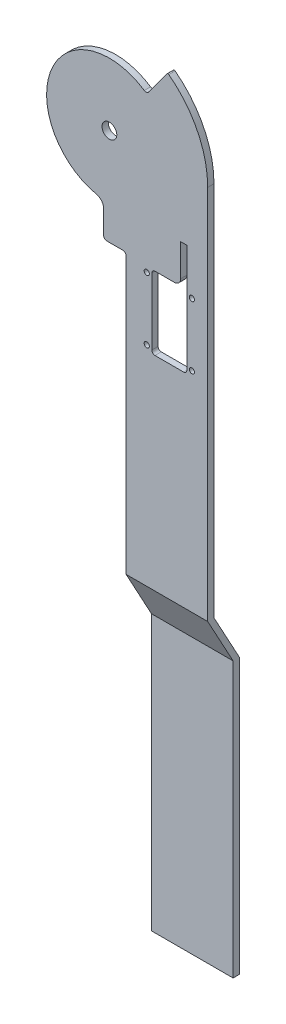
ISO-10303-21;
HEADER;
FILE_DESCRIPTION(('STEP AP214'),'2;1');
FILE_NAME('part.step','',(''),(''),'','','');
FILE_SCHEMA(('AUTOMOTIVE_DESIGN { 1 0 10303 214 1 1 1 1 }'));
ENDSEC;
DATA;
#1=APPLICATION_CONTEXT('core data for automotive mechanical design processes');
#2=APPLICATION_PROTOCOL_DEFINITION('international standard','automotive_design',2000,#1);
#3=PRODUCT_CONTEXT('',#1,'mechanical');
#4=PRODUCT('Part','Part','',(#3));
#5=PRODUCT_RELATED_PRODUCT_CATEGORY('part','',(#4));
#6=PRODUCT_DEFINITION_FORMATION('','',#4);
#7=PRODUCT_DEFINITION_CONTEXT('part definition',#1,'design');
#8=PRODUCT_DEFINITION('design','',#6,#7);
#9=PRODUCT_DEFINITION_SHAPE('','',#8);
#10=(LENGTH_UNIT() NAMED_UNIT(*) SI_UNIT(.MILLI.,.METRE.));
#11=(NAMED_UNIT(*) PLANE_ANGLE_UNIT() SI_UNIT($,.RADIAN.));
#12=(NAMED_UNIT(*) SI_UNIT($,.STERADIAN.) SOLID_ANGLE_UNIT());
#13=UNCERTAINTY_MEASURE_WITH_UNIT(LENGTH_MEASURE(1.E-05),#10,'distance_accuracy_value','');
#14=(GEOMETRIC_REPRESENTATION_CONTEXT(3) GLOBAL_UNCERTAINTY_ASSIGNED_CONTEXT((#13)) GLOBAL_UNIT_ASSIGNED_CONTEXT((#10,
#11,#12)) REPRESENTATION_CONTEXT('',''));
#15=CARTESIAN_POINT('',(0.,0.,0.));
#16=DIRECTION('',(0.,0.,1.));
#17=DIRECTION('',(1.,0.,0.));
#18=AXIS2_PLACEMENT_3D('',#15,#16,#17);
#19=CARTESIAN_POINT('',(14.803504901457,22.1843445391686,1.27));
#20=DIRECTION('',(0.,0.,-1.));
#21=DIRECTION('',(-1.,0.,0.));
#22=AXIS2_PLACEMENT_3D('',#19,#20,#21);
#23=CYLINDRICAL_SURFACE('',#22,1.27);
#24=CARTESIAN_POINT('',(14.803504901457,22.1843445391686,-1.27));
#25=DIRECTION('',(0.,0.,1.));
#26=DIRECTION('',(1.,0.,0.));
#27=AXIS2_PLACEMENT_3D('',#24,#25,#26);
#28=CIRCLE('',#27,1.27);
#29=CARTESIAN_POINT('',(14.0985760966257,21.1279471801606,-1.27));
#30=VERTEX_POINT('',#29);
#31=CARTESIAN_POINT('',(15.8251358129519,21.4299107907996,-1.27));
#32=VERTEX_POINT('',#31);
#33=EDGE_CURVE('E268',#30,#32,#28,.T.);
#34=ORIENTED_EDGE('',*,*,#33,.F.);
#35=DIRECTION('',(0.,0.,-1.));
#36=VECTOR('',#35,1.);
#37=CARTESIAN_POINT('',(14.0985760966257,21.1279471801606,1.27));
#38=LINE('',#37,#36);
#39=CARTESIAN_POINT('',(14.0985760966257,21.1279471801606,1.27));
#40=VERTEX_POINT('',#39);
#41=EDGE_CURVE('E11',#40,#30,#38,.T.);
#42=ORIENTED_EDGE('',*,*,#41,.F.);
#43=CARTESIAN_POINT('',(14.803504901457,22.1843445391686,1.27));
#44=DIRECTION('',(0.,0.,1.));
#45=DIRECTION('',(1.,0.,0.));
#46=AXIS2_PLACEMENT_3D('',#43,#44,#45);
#47=CIRCLE('',#46,1.27);
#48=CARTESIAN_POINT('',(15.8251358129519,21.4299107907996,1.27));
#49=VERTEX_POINT('',#48);
#50=EDGE_CURVE('E398',#40,#49,#47,.T.);
#51=ORIENTED_EDGE('',*,*,#50,.T.);
#52=DIRECTION('',(0.,0.,-1.));
#53=VECTOR('',#52,1.);
#54=CARTESIAN_POINT('',(15.8251358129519,21.4299107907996,1.27));
#55=LINE('',#54,#53);
#56=EDGE_CURVE('E55',#49,#32,#55,.T.);
#57=ORIENTED_EDGE('',*,*,#56,.T.);
#58=EDGE_LOOP('',(#34,#42,#51,#57));
#59=FACE_BOUND('',#58,.T.);
#60=ADVANCED_FACE('F36',(#59),#23,.F.);
#61=CARTESIAN_POINT('',(0.,0.,1.27));
#62=DIRECTION('',(0.,0.,-1.));
#63=DIRECTION('',(-1.,0.,0.));
#64=AXIS2_PLACEMENT_3D('',#61,#62,#63);
#65=CYLINDRICAL_SURFACE('',#64,25.4);
#66=CARTESIAN_POINT('',(0.,0.,-1.27));
#67=DIRECTION('',(0.,0.,1.));
#68=DIRECTION('',(1.,0.,0.));
#69=AXIS2_PLACEMENT_3D('',#66,#67,#68);
#70=CIRCLE('',#69,25.4);
#71=CARTESIAN_POINT('',(-5.32331397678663,-24.8359080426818,-1.27));
#72=VERTEX_POINT('',#71);
#73=EDGE_CURVE('E270',#30,#72,#70,.T.);
#74=ORIENTED_EDGE('',*,*,#73,.T.);
#75=DIRECTION('',(0.,0.,-1.));
#76=VECTOR('',#75,1.);
#77=CARTESIAN_POINT('',(-5.32331397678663,-24.8359080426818,1.27));
#78=LINE('',#77,#76);
#79=CARTESIAN_POINT('',(-5.32331397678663,-24.8359080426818,1.27));
#80=VERTEX_POINT('',#79);
#81=EDGE_CURVE('E46',#80,#72,#78,.T.);
#82=ORIENTED_EDGE('',*,*,#81,.F.);
#83=CARTESIAN_POINT('',(0.,0.,1.27));
#84=DIRECTION('',(0.,0.,1.));
#85=DIRECTION('',(1.,0.,0.));
#86=AXIS2_PLACEMENT_3D('',#83,#84,#85);
#87=CIRCLE('',#86,25.4);
#88=EDGE_CURVE('E400',#40,#80,#87,.T.);
#89=ORIENTED_EDGE('',*,*,#88,.F.);
#90=ORIENTED_EDGE('',*,*,#41,.T.);
#91=EDGE_LOOP('',(#74,#82,#89,#90));
#92=FACE_BOUND('',#91,.T.);
#93=ADVANCED_FACE('F497',(#92),#65,.T.);
#94=CARTESIAN_POINT('',(-6.12181107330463,-28.5612942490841,1.27));
#95=DIRECTION('',(0.,0.,-1.));
#96=DIRECTION('',(-1.,0.,0.));
#97=AXIS2_PLACEMENT_3D('',#94,#95,#96);
#98=CYLINDRICAL_SURFACE('',#97,3.81);
#99=CARTESIAN_POINT('',(-6.12181107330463,-28.5612942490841,-1.27));
#100=DIRECTION('',(0.,0.,1.));
#101=DIRECTION('',(1.,0.,0.));
#102=AXIS2_PLACEMENT_3D('',#99,#100,#101);
#103=CIRCLE('',#102,3.81);
#104=CARTESIAN_POINT('',(-2.31181107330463,-28.5612942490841,-1.27));
#105=VERTEX_POINT('',#104);
#106=EDGE_CURVE('E273',#105,#72,#103,.T.);
#107=ORIENTED_EDGE('',*,*,#106,.F.);
#108=DIRECTION('',(0.,0.,-1.));
#109=VECTOR('',#108,1.);
#110=CARTESIAN_POINT('',(-2.31181107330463,-28.5612942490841,1.27));
#111=LINE('',#110,#109);
#112=CARTESIAN_POINT('',(-2.31181107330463,-28.5612942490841,1.27));
#113=VERTEX_POINT('',#112);
#114=EDGE_CURVE('E322',#113,#105,#111,.T.);
#115=ORIENTED_EDGE('',*,*,#114,.F.);
#116=CARTESIAN_POINT('',(-6.12181107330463,-28.5612942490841,1.27));
#117=DIRECTION('',(0.,0.,1.));
#118=DIRECTION('',(1.,0.,0.));
#119=AXIS2_PLACEMENT_3D('',#116,#117,#118);
#120=CIRCLE('',#119,3.81);
#121=EDGE_CURVE('E402',#113,#80,#120,.T.);
#122=ORIENTED_EDGE('',*,*,#121,.T.);
#123=ORIENTED_EDGE('',*,*,#81,.T.);
#124=EDGE_LOOP('',(#107,#115,#122,#123));
#125=FACE_BOUND('',#124,.T.);
#126=ADVANCED_FACE('F502',(#125),#98,.F.);
#127=CARTESIAN_POINT('',(-2.31181107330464,0.,1.27));
#128=DIRECTION('',(1.,0.,0.));
#129=DIRECTION('',(0.,1.,0.));
#130=AXIS2_PLACEMENT_3D('',#127,#128,#129);
#131=PLANE('',#130);
#132=DIRECTION('',(0.,-1.,0.));
#133=VECTOR('',#132,1.);
#134=CARTESIAN_POINT('',(-2.31181107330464,0.,-1.27));
#135=LINE('',#134,#133);
#136=CARTESIAN_POINT('',(-2.31181107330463,-37.9049266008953,-1.27));
#137=VERTEX_POINT('',#136);
#138=EDGE_CURVE('E276',#105,#137,#135,.T.);
#139=ORIENTED_EDGE('',*,*,#138,.T.);
#140=DIRECTION('',(0.,0.,-1.));
#141=VECTOR('',#140,1.);
#142=CARTESIAN_POINT('',(-2.31181107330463,-37.9049266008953,1.27));
#143=LINE('',#142,#141);
#144=CARTESIAN_POINT('',(-2.31181107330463,-37.9049266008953,1.27));
#145=VERTEX_POINT('',#144);
#146=EDGE_CURVE('E320',#145,#137,#143,.T.);
#147=ORIENTED_EDGE('',*,*,#146,.F.);
#148=DIRECTION('',(0.,-1.,0.));
#149=VECTOR('',#148,1.);
#150=CARTESIAN_POINT('',(-2.31181107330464,0.,1.27));
#151=LINE('',#150,#149);
#152=EDGE_CURVE('E405',#113,#145,#151,.T.);
#153=ORIENTED_EDGE('',*,*,#152,.F.);
#154=ORIENTED_EDGE('',*,*,#114,.T.);
#155=EDGE_LOOP('',(#139,#147,#153,#154));
#156=FACE_BOUND('',#155,.T.);
#157=ADVANCED_FACE('F763',(#156),#131,.F.);
#158=CARTESIAN_POINT('',(-1.04181107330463,-37.9049266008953,1.27));
#159=DIRECTION('',(0.,0.,-1.));
#160=DIRECTION('',(-1.,0.,0.));
#161=AXIS2_PLACEMENT_3D('',#158,#159,#160);
#162=CYLINDRICAL_SURFACE('',#161,1.27);
#163=CARTESIAN_POINT('',(-1.04181107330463,-37.9049266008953,-1.27));
#164=DIRECTION('',(0.,0.,1.));
#165=DIRECTION('',(1.,0.,0.));
#166=AXIS2_PLACEMENT_3D('',#163,#164,#165);
#167=CIRCLE('',#166,1.27);
#168=CARTESIAN_POINT('',(-1.04181107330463,-39.1749266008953,-1.27));
#169=VERTEX_POINT('',#168);
#170=EDGE_CURVE('E279',#169,#137,#167,.F.);
#171=ORIENTED_EDGE('',*,*,#170,.F.);
#172=DIRECTION('',(0.,0.,-1.));
#173=VECTOR('',#172,1.);
#174=CARTESIAN_POINT('',(-1.04181107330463,-39.1749266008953,1.27));
#175=LINE('',#174,#173);
#176=CARTESIAN_POINT('',(-1.04181107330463,-39.1749266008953,1.27));
#177=VERTEX_POINT('',#176);
#178=EDGE_CURVE('E318',#177,#169,#175,.T.);
#179=ORIENTED_EDGE('',*,*,#178,.F.);
#180=CARTESIAN_POINT('',(-1.04181107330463,-37.9049266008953,1.27));
#181=DIRECTION('',(0.,0.,1.));
#182=DIRECTION('',(1.,0.,0.));
#183=AXIS2_PLACEMENT_3D('',#180,#181,#182);
#184=CIRCLE('',#183,1.27);
#185=EDGE_CURVE('E407',#177,#145,#184,.F.);
#186=ORIENTED_EDGE('',*,*,#185,.T.);
#187=ORIENTED_EDGE('',*,*,#146,.T.);
#188=EDGE_LOOP('',(#171,#179,#186,#187));
#189=FACE_BOUND('',#188,.T.);
#190=ADVANCED_FACE('F753',(#189),#162,.T.);
#191=CARTESIAN_POINT('',(0.,-39.1749266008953,1.27));
#192=DIRECTION('',(0.,1.,0.));
#193=DIRECTION('',(0.,0.,1.));
#194=AXIS2_PLACEMENT_3D('',#191,#192,#193);
#195=PLANE('',#194);
#196=DIRECTION('',(1.,0.,0.));
#197=VECTOR('',#196,1.);
#198=CARTESIAN_POINT('',(0.,-39.1749266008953,-1.27));
#199=LINE('',#198,#197);
#200=CARTESIAN_POINT('',(5.49328163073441,-39.1749266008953,-1.27));
#201=VERTEX_POINT('',#200);
#202=EDGE_CURVE('E282',#169,#201,#199,.T.);
#203=ORIENTED_EDGE('',*,*,#202,.T.);
#204=DIRECTION('',(0.,0.,-1.));
#205=VECTOR('',#204,1.);
#206=CARTESIAN_POINT('',(5.49328163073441,-39.1749266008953,1.27));
#207=LINE('',#206,#205);
#208=CARTESIAN_POINT('',(5.49328163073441,-39.1749266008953,1.27));
#209=VERTEX_POINT('',#208);
#210=EDGE_CURVE('E315',#209,#201,#207,.T.);
#211=ORIENTED_EDGE('',*,*,#210,.F.);
#212=DIRECTION('',(1.,0.,0.));
#213=VECTOR('',#212,1.);
#214=CARTESIAN_POINT('',(0.,-39.1749266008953,1.27));
#215=LINE('',#214,#213);
#216=EDGE_CURVE('E410',#177,#209,#215,.T.);
#217=ORIENTED_EDGE('',*,*,#216,.F.);
#218=ORIENTED_EDGE('',*,*,#178,.T.);
#219=EDGE_LOOP('',(#203,#211,#217,#218));
#220=FACE_BOUND('',#219,.T.);
#221=ADVANCED_FACE('F743',(#220),#195,.F.);
#222=CARTESIAN_POINT('',(5.49328163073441,-40.4449266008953,1.27));
#223=DIRECTION('',(0.,0.,-1.));
#224=DIRECTION('',(-1.,0.,0.));
#225=AXIS2_PLACEMENT_3D('',#222,#223,#224);
#226=CYLINDRICAL_SURFACE('',#225,1.27);
#227=CARTESIAN_POINT('',(5.49328163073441,-40.4449266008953,-1.27));
#228=DIRECTION('',(0.,0.,1.));
#229=DIRECTION('',(1.,0.,0.));
#230=AXIS2_PLACEMENT_3D('',#227,#228,#229);
#231=CIRCLE('',#230,1.27);
#232=CARTESIAN_POINT('',(6.76328163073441,-40.4449266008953,-1.27));
#233=VERTEX_POINT('',#232);
#234=EDGE_CURVE('E285',#201,#233,#231,.F.);
#235=ORIENTED_EDGE('',*,*,#234,.T.);
#236=DIRECTION('',(0.,0.,-1.));
#237=VECTOR('',#236,1.);
#238=CARTESIAN_POINT('',(6.76328163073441,-40.4449266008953,1.27));
#239=LINE('',#238,#237);
#240=CARTESIAN_POINT('',(6.76328163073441,-40.4449266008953,1.27));
#241=VERTEX_POINT('',#240);
#242=EDGE_CURVE('E312',#241,#233,#239,.T.);
#243=ORIENTED_EDGE('',*,*,#242,.F.);
#244=CARTESIAN_POINT('',(5.49328163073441,-40.4449266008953,1.27));
#245=DIRECTION('',(0.,0.,1.));
#246=DIRECTION('',(1.,0.,0.));
#247=AXIS2_PLACEMENT_3D('',#244,#245,#246);
#248=CIRCLE('',#247,1.27);
#249=EDGE_CURVE('E413',#209,#241,#248,.F.);
#250=ORIENTED_EDGE('',*,*,#249,.F.);
#251=ORIENTED_EDGE('',*,*,#210,.T.);
#252=EDGE_LOOP('',(#235,#243,#250,#251));
#253=FACE_BOUND('',#252,.T.);
#254=ADVANCED_FACE('F657',(#253),#226,.F.);
#255=CARTESIAN_POINT('',(6.76328163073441,0.,1.27));
#256=DIRECTION('',(1.,0.,0.));
#257=DIRECTION('',(0.,0.,-1.));
#258=AXIS2_PLACEMENT_3D('',#255,#256,#257);
#259=PLANE('',#258);
#260=DIRECTION('',(0.,-1.,0.));
#261=VECTOR('',#260,1.);
#262=CARTESIAN_POINT('',(6.76328163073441,0.,-1.27));
#263=LINE('',#262,#261);
#264=CARTESIAN_POINT('',(6.76328163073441,-152.047689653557,-1.27));
#265=VERTEX_POINT('',#264);
#266=EDGE_CURVE('E288',#233,#265,#263,.T.);
#267=ORIENTED_EDGE('',*,*,#266,.T.);
#268=DIRECTION('',(0.,0.878888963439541,0.477026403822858));
#269=VECTOR('',#268,1.);
#270=CARTESIAN_POINT('',(6.76328163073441,-152.047689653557,-1.27));
#271=LINE('',#270,#269);
#272=CARTESIAN_POINT('',(6.76328163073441,-170.9865012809,-11.5492429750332));
#273=VERTEX_POINT('',#272);
#274=EDGE_CURVE('E441',#273,#265,#271,.T.);
#275=ORIENTED_EDGE('',*,*,#274,.F.);
#276=DIRECTION('',(0.,1.,0.));
#277=VECTOR('',#276,1.);
#278=CARTESIAN_POINT('',(6.76328163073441,-170.9865012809,-11.5492429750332));
#279=LINE('',#278,#277);
#280=CARTESIAN_POINT('',(6.76328163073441,-282.070860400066,-11.5492429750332));
#281=VERTEX_POINT('',#280);
#282=EDGE_CURVE('E841',#281,#273,#279,.T.);
#283=ORIENTED_EDGE('',*,*,#282,.F.);
#284=DIRECTION('',(0.,0.,-1.));
#285=VECTOR('',#284,1.);
#286=CARTESIAN_POINT('',(6.76328163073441,-282.070860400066,-11.5492429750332));
#287=LINE('',#286,#285);
#288=CARTESIAN_POINT('',(6.76328163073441,-282.070860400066,-9.00924297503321));
#289=VERTEX_POINT('',#288);
#290=EDGE_CURVE('E837',#289,#281,#287,.T.);
#291=ORIENTED_EDGE('',*,*,#290,.F.);
#292=DIRECTION('',(0.,-1.,0.));
#293=VECTOR('',#292,1.);
#294=CARTESIAN_POINT('',(6.76328163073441,-170.9865012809,-9.00924297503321));
#295=LINE('',#294,#293);
#296=CARTESIAN_POINT('',(6.76328163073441,-170.9865012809,-9.00924297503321));
#297=VERTEX_POINT('',#296);
#298=EDGE_CURVE('E835',#297,#289,#295,.T.);
#299=ORIENTED_EDGE('',*,*,#298,.F.);
#300=DIRECTION('',(0.,-0.878888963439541,-0.477026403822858));
#301=VECTOR('',#300,1.);
#302=CARTESIAN_POINT('',(6.76328163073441,-152.047689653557,1.27));
#303=LINE('',#302,#301);
#304=CARTESIAN_POINT('',(6.76328163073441,-152.047689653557,1.27));
#305=VERTEX_POINT('',#304);
#306=EDGE_CURVE('E452',#305,#297,#303,.T.);
#307=ORIENTED_EDGE('',*,*,#306,.F.);
#308=DIRECTION('',(0.,-1.,0.));
#309=VECTOR('',#308,1.);
#310=CARTESIAN_POINT('',(6.76328163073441,0.,1.27));
#311=LINE('',#310,#309);
#312=EDGE_CURVE('E416',#241,#305,#311,.T.);
#313=ORIENTED_EDGE('',*,*,#312,.F.);
#314=ORIENTED_EDGE('',*,*,#242,.T.);
#315=EDGE_LOOP('',(#267,#275,#283,#291,#299,#307,#313,#314));
#316=FACE_BOUND('',#315,.T.);
#317=ADVANCED_FACE('F647',(#316),#259,.F.);
#318=CARTESIAN_POINT('',(39.7544570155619,0.,1.27));
#319=DIRECTION('',(1.,0.,0.));
#320=DIRECTION('',(0.,0.,-1.));
#321=AXIS2_PLACEMENT_3D('',#318,#319,#320);
#322=PLANE('',#321);
#323=DIRECTION('',(0.,-1.,0.));
#324=VECTOR('',#323,1.);
#325=CARTESIAN_POINT('',(39.7544570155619,0.,-1.27));
#326=LINE('',#325,#324);
#327=CARTESIAN_POINT('',(39.7544570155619,0.,-1.27));
#328=VERTEX_POINT('',#327);
#329=CARTESIAN_POINT('',(39.7544570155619,-152.047689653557,-1.27));
#330=VERTEX_POINT('',#329);
#331=EDGE_CURVE('E294',#328,#330,#326,.T.);
#332=ORIENTED_EDGE('',*,*,#331,.F.);
#333=DIRECTION('',(0.,0.,-1.));
#334=VECTOR('',#333,1.);
#335=CARTESIAN_POINT('',(39.7544570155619,0.,1.27));
#336=LINE('',#335,#334);
#337=CARTESIAN_POINT('',(39.7544570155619,0.,1.27));
#338=VERTEX_POINT('',#337);
#339=EDGE_CURVE('E209',#338,#328,#336,.T.);
#340=ORIENTED_EDGE('',*,*,#339,.F.);
#341=DIRECTION('',(0.,-1.,0.));
#342=VECTOR('',#341,1.);
#343=CARTESIAN_POINT('',(39.7544570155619,0.,1.27));
#344=LINE('',#343,#342);
#345=CARTESIAN_POINT('',(39.7544570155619,-152.047689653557,1.27));
#346=VERTEX_POINT('',#345);
#347=EDGE_CURVE('E220',#338,#346,#344,.T.);
#348=ORIENTED_EDGE('',*,*,#347,.T.);
#349=DIRECTION('',(0.,-0.878888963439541,-0.477026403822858));
#350=VECTOR('',#349,1.);
#351=CARTESIAN_POINT('',(39.7544570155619,-152.047689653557,1.27));
#352=LINE('',#351,#350);
#353=CARTESIAN_POINT('',(39.7544570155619,-170.9865012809,-9.00924297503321));
#354=VERTEX_POINT('',#353);
#355=EDGE_CURVE('E426',#346,#354,#352,.T.);
#356=ORIENTED_EDGE('',*,*,#355,.T.);
#357=DIRECTION('',(0.,-1.,0.));
#358=VECTOR('',#357,1.);
#359=CARTESIAN_POINT('',(39.7544570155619,-170.9865012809,-9.00924297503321));
#360=LINE('',#359,#358);
#361=CARTESIAN_POINT('',(39.7544570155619,-282.070860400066,-9.00924297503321));
#362=VERTEX_POINT('',#361);
#363=EDGE_CURVE('E436',#354,#362,#360,.T.);
#364=ORIENTED_EDGE('',*,*,#363,.T.);
#365=DIRECTION('',(0.,0.,-1.));
#366=VECTOR('',#365,1.);
#367=CARTESIAN_POINT('',(39.7544570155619,-282.070860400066,-11.5492429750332));
#368=LINE('',#367,#366);
#369=CARTESIAN_POINT('',(39.7544570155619,-282.070860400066,-11.5492429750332));
#370=VERTEX_POINT('',#369);
#371=EDGE_CURVE('E438',#362,#370,#368,.T.);
#372=ORIENTED_EDGE('',*,*,#371,.T.);
#373=DIRECTION('',(0.,1.,0.));
#374=VECTOR('',#373,1.);
#375=CARTESIAN_POINT('',(39.7544570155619,-170.9865012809,-11.5492429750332));
#376=LINE('',#375,#374);
#377=CARTESIAN_POINT('',(39.7544570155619,-170.9865012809,-11.5492429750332));
#378=VERTEX_POINT('',#377);
#379=EDGE_CURVE('E446',#370,#378,#376,.T.);
#380=ORIENTED_EDGE('',*,*,#379,.T.);
#381=DIRECTION('',(0.,0.878888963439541,0.477026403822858));
#382=VECTOR('',#381,1.);
#383=CARTESIAN_POINT('',(39.7544570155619,-152.047689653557,-1.27));
#384=LINE('',#383,#382);
#385=EDGE_CURVE('E449',#378,#330,#384,.T.);
#386=ORIENTED_EDGE('',*,*,#385,.T.);
#387=EDGE_LOOP('',(#332,#340,#348,#356,#364,#372,#380,#386));
#388=FACE_BOUND('',#387,.T.);
#389=ADVANCED_FACE('F423',(#388),#322,.T.);
#390=CARTESIAN_POINT('',(-1.59594559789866E-13,0.,1.27));
#391=DIRECTION('',(0.,0.,-1.));
#392=DIRECTION('',(-1.,0.,0.));
#393=AXIS2_PLACEMENT_3D('',#390,#391,#392);
#394=CYLINDRICAL_SURFACE('',#393,39.7544570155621);
#395=CARTESIAN_POINT('',(-1.59594559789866E-13,0.,-1.27));
#396=DIRECTION('',(0.,0.,1.));
#397=DIRECTION('',(1.,0.,0.));
#398=AXIS2_PLACEMENT_3D('',#395,#396,#397);
#399=CIRCLE('',#398,39.7544570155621);
#400=CARTESIAN_POINT('',(24.0277934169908,31.6714697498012,-1.27));
#401=VERTEX_POINT('',#400);
#402=EDGE_CURVE('E205',#401,#328,#399,.F.);
#403=ORIENTED_EDGE('',*,*,#402,.F.);
#404=DIRECTION('',(0.,0.,-1.));
#405=VECTOR('',#404,1.);
#406=CARTESIAN_POINT('',(24.0277934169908,31.6714697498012,1.27));
#407=LINE('',#406,#405);
#408=CARTESIAN_POINT('',(24.0277934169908,31.6714697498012,1.27));
#409=VERTEX_POINT('',#408);
#410=EDGE_CURVE('E200',#409,#401,#407,.T.);
#411=ORIENTED_EDGE('',*,*,#410,.F.);
#412=CARTESIAN_POINT('',(-1.59594559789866E-13,0.,1.27));
#413=DIRECTION('',(0.,0.,1.));
#414=DIRECTION('',(1.,0.,0.));
#415=AXIS2_PLACEMENT_3D('',#412,#413,#414);
#416=CIRCLE('',#415,39.7544570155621);
#417=EDGE_CURVE('E203',#409,#338,#416,.F.);
#418=ORIENTED_EDGE('',*,*,#417,.T.);
#419=ORIENTED_EDGE('',*,*,#339,.T.);
#420=EDGE_LOOP('',(#403,#411,#418,#419));
#421=FACE_BOUND('',#420,.T.);
#422=ADVANCED_FACE('F202',(#421),#394,.T.);
#423=CARTESIAN_POINT('',(23.7207556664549,31.2667577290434,1.27));
#424=DIRECTION('',(0.,0.,-1.));
#425=DIRECTION('',(-1.,0.,0.));
#426=AXIS2_PLACEMENT_3D('',#423,#424,#425);
#427=CYLINDRICAL_SURFACE('',#426,0.508000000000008);
#428=CARTESIAN_POINT('',(23.7207556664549,31.2667577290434,-1.27));
#429=DIRECTION('',(0.,0.,1.));
#430=DIRECTION('',(1.,0.,0.));
#431=AXIS2_PLACEMENT_3D('',#428,#429,#430);
#432=CIRCLE('',#431,0.508000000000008);
#433=CARTESIAN_POINT('',(23.312103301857,31.568531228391,-1.27));
#434=VERTEX_POINT('',#433);
#435=EDGE_CURVE('E297',#434,#401,#432,.F.);
#436=ORIENTED_EDGE('',*,*,#435,.F.);
#437=DIRECTION('',(0.,0.,-1.));
#438=VECTOR('',#437,1.);
#439=CARTESIAN_POINT('',(23.312103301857,31.568531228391,1.27));
#440=LINE('',#439,#438);
#441=CARTESIAN_POINT('',(23.312103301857,31.568531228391,1.27));
#442=VERTEX_POINT('',#441);
#443=EDGE_CURVE('E123',#442,#434,#440,.T.);
#444=ORIENTED_EDGE('',*,*,#443,.F.);
#445=CARTESIAN_POINT('',(23.7207556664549,31.2667577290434,1.27));
#446=DIRECTION('',(0.,0.,1.));
#447=DIRECTION('',(1.,0.,0.));
#448=AXIS2_PLACEMENT_3D('',#445,#446,#447);
#449=CIRCLE('',#448,0.508000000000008);
#450=EDGE_CURVE('E218',#442,#409,#449,.F.);
#451=ORIENTED_EDGE('',*,*,#450,.T.);
#452=ORIENTED_EDGE('',*,*,#410,.T.);
#453=EDGE_LOOP('',(#436,#444,#451,#452));
#454=FACE_BOUND('',#453,.T.);
#455=ADVANCED_FACE('F222',(#454),#427,.T.);
#456=CARTESIAN_POINT('',(28.8192708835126,0.,1.27));
#457=DIRECTION('',(-1.,0.,0.));
#458=DIRECTION('',(0.,0.,1.));
#459=AXIS2_PLACEMENT_3D('',#456,#457,#458);
#460=PLANE('',#459);
#461=DIRECTION('',(0.,1.,0.));
#462=VECTOR('',#461,1.);
#463=CARTESIAN_POINT('',(28.8192708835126,0.,-1.27));
#464=LINE('',#463,#462);
#465=CARTESIAN_POINT('',(28.8192708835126,-37.46859003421,-1.27));
#466=VERTEX_POINT('',#465);
#467=CARTESIAN_POINT('',(28.8192708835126,-24.4667427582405,-1.27));
#468=VERTEX_POINT('',#467);
#469=EDGE_CURVE('E235',#466,#468,#464,.T.);
#470=ORIENTED_EDGE('',*,*,#469,.T.);
#471=DIRECTION('',(0.,0.,-1.));
#472=VECTOR('',#471,1.);
#473=CARTESIAN_POINT('',(28.8192708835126,-24.4667427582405,1.27));
#474=LINE('',#473,#472);
#475=CARTESIAN_POINT('',(28.8192708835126,-24.4667427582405,1.27));
#476=VERTEX_POINT('',#475);
#477=EDGE_CURVE('E40',#476,#468,#474,.T.);
#478=ORIENTED_EDGE('',*,*,#477,.F.);
#479=DIRECTION('',(0.,1.,0.));
#480=VECTOR('',#479,1.);
#481=CARTESIAN_POINT('',(28.8192708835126,0.,1.27));
#482=LINE('',#481,#480);
#483=CARTESIAN_POINT('',(28.8192708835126,-37.46859003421,1.27));
#484=VERTEX_POINT('',#483);
#485=EDGE_CURVE('E308',#484,#476,#482,.T.);
#486=ORIENTED_EDGE('',*,*,#485,.F.);
#487=DIRECTION('',(0.,0.,-1.));
#488=VECTOR('',#487,1.);
#489=CARTESIAN_POINT('',(28.8192708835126,-37.46859003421,1.27));
#490=LINE('',#489,#488);
#491=EDGE_CURVE('E234',#484,#466,#490,.T.);
#492=ORIENTED_EDGE('',*,*,#491,.T.);
#493=EDGE_LOOP('',(#470,#478,#486,#492));
#494=FACE_BOUND('',#493,.T.);
#495=ADVANCED_FACE('F38',(#494),#460,.F.);
#496=CARTESIAN_POINT('',(0.,-24.4667427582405,1.27));
#497=DIRECTION('',(0.,1.,0.));
#498=DIRECTION('',(0.,0.,1.));
#499=AXIS2_PLACEMENT_3D('',#496,#497,#498);
#500=PLANE('',#499);
#501=DIRECTION('',(1.,0.,0.));
#502=VECTOR('',#501,1.);
#503=CARTESIAN_POINT('',(0.,-24.4667427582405,-1.27));
#504=LINE('',#503,#502);
#505=CARTESIAN_POINT('',(31.3336137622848,-24.4667427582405,-1.27));
#506=VERTEX_POINT('',#505);
#507=EDGE_CURVE('E238',#468,#506,#504,.T.);
#508=ORIENTED_EDGE('',*,*,#507,.T.);
#509=DIRECTION('',(0.,0.,-1.));
#510=VECTOR('',#509,1.);
#511=CARTESIAN_POINT('',(31.3336137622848,-24.4667427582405,1.27));
#512=LINE('',#511,#510);
#513=CARTESIAN_POINT('',(31.3336137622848,-24.4667427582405,1.27));
#514=VERTEX_POINT('',#513);
#515=EDGE_CURVE('E345',#514,#506,#512,.T.);
#516=ORIENTED_EDGE('',*,*,#515,.F.);
#517=DIRECTION('',(1.,0.,0.));
#518=VECTOR('',#517,1.);
#519=CARTESIAN_POINT('',(0.,-24.4667427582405,1.27));
#520=LINE('',#519,#518);
#521=EDGE_CURVE('E136',#476,#514,#520,.T.);
#522=ORIENTED_EDGE('',*,*,#521,.F.);
#523=ORIENTED_EDGE('',*,*,#477,.T.);
#524=EDGE_LOOP('',(#508,#516,#522,#523));
#525=FACE_BOUND('',#524,.T.);
#526=ADVANCED_FACE('F351',(#525),#500,.F.);
#527=CARTESIAN_POINT('',(31.3336137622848,0.,1.27));
#528=DIRECTION('',(1.,0.,0.));
#529=DIRECTION('',(0.,1.,0.));
#530=AXIS2_PLACEMENT_3D('',#527,#528,#529);
#531=PLANE('',#530);
#532=DIRECTION('',(0.,-1.,0.));
#533=VECTOR('',#532,1.);
#534=CARTESIAN_POINT('',(31.3336137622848,0.,-1.27));
#535=LINE('',#534,#533);
#536=CARTESIAN_POINT('',(31.3336137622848,-68.278700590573,-1.27));
#537=VERTEX_POINT('',#536);
#538=EDGE_CURVE('E241',#506,#537,#535,.T.);
#539=ORIENTED_EDGE('',*,*,#538,.T.);
#540=DIRECTION('',(0.,0.,-1.));
#541=VECTOR('',#540,1.);
#542=CARTESIAN_POINT('',(31.3336137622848,-68.278700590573,1.27));
#543=LINE('',#542,#541);
#544=CARTESIAN_POINT('',(31.3336137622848,-68.278700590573,1.27));
#545=VERTEX_POINT('',#544);
#546=EDGE_CURVE('E344',#545,#537,#543,.T.);
#547=ORIENTED_EDGE('',*,*,#546,.F.);
#548=DIRECTION('',(0.,-1.,0.));
#549=VECTOR('',#548,1.);
#550=CARTESIAN_POINT('',(31.3336137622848,0.,1.27));
#551=LINE('',#550,#549);
#552=EDGE_CURVE('E366',#514,#545,#551,.T.);
#553=ORIENTED_EDGE('',*,*,#552,.F.);
#554=ORIENTED_EDGE('',*,*,#515,.T.);
#555=EDGE_LOOP('',(#539,#547,#553,#554));
#556=FACE_BOUND('',#555,.T.);
#557=ADVANCED_FACE('F364',(#556),#531,.F.);
#558=CARTESIAN_POINT('',(30.0636137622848,-68.278700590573,1.27));
#559=DIRECTION('',(0.,0.,-1.));
#560=DIRECTION('',(-1.,0.,0.));
#561=AXIS2_PLACEMENT_3D('',#558,#559,#560);
#562=CYLINDRICAL_SURFACE('',#561,1.27);
#563=CARTESIAN_POINT('',(30.0636137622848,-68.278700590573,-1.27));
#564=DIRECTION('',(0.,0.,1.));
#565=DIRECTION('',(1.,0.,0.));
#566=AXIS2_PLACEMENT_3D('',#563,#564,#565);
#567=CIRCLE('',#566,1.27);
#568=CARTESIAN_POINT('',(30.0636137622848,-69.548700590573,-1.27));
#569=VERTEX_POINT('',#568);
#570=EDGE_CURVE('E244',#569,#537,#567,.T.);
#571=ORIENTED_EDGE('',*,*,#570,.F.);
#572=DIRECTION('',(0.,0.,-1.));
#573=VECTOR('',#572,1.);
#574=CARTESIAN_POINT('',(30.0636137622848,-69.548700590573,1.27));
#575=LINE('',#574,#573);
#576=CARTESIAN_POINT('',(30.0636137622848,-69.548700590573,1.27));
#577=VERTEX_POINT('',#576);
#578=EDGE_CURVE('E342',#577,#569,#575,.T.);
#579=ORIENTED_EDGE('',*,*,#578,.F.);
#580=CARTESIAN_POINT('',(30.0636137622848,-68.278700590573,1.27));
#581=DIRECTION('',(0.,0.,1.));
#582=DIRECTION('',(1.,0.,0.));
#583=AXIS2_PLACEMENT_3D('',#580,#581,#582);
#584=CIRCLE('',#583,1.27);
#585=EDGE_CURVE('E369',#577,#545,#584,.T.);
#586=ORIENTED_EDGE('',*,*,#585,.T.);
#587=ORIENTED_EDGE('',*,*,#546,.T.);
#588=EDGE_LOOP('',(#571,#579,#586,#587));
#589=FACE_BOUND('',#588,.T.);
#590=ADVANCED_FACE('F370',(#589),#562,.F.);
#591=CARTESIAN_POINT('',(0.,-69.548700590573,1.27));
#592=DIRECTION('',(0.,-1.,0.));
#593=DIRECTION('',(0.,0.,-1.));
#594=AXIS2_PLACEMENT_3D('',#591,#592,#593);
#595=PLANE('',#594);
#596=DIRECTION('',(-1.,0.,0.));
#597=VECTOR('',#596,1.);
#598=CARTESIAN_POINT('',(0.,-69.548700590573,-1.27));
#599=LINE('',#598,#597);
#600=CARTESIAN_POINT('',(18.419700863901,-69.548700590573,-1.27));
#601=VERTEX_POINT('',#600);
#602=EDGE_CURVE('E247',#569,#601,#599,.T.);
#603=ORIENTED_EDGE('',*,*,#602,.T.);
#604=DIRECTION('',(0.,0.,-1.));
#605=VECTOR('',#604,1.);
#606=CARTESIAN_POINT('',(18.419700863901,-69.548700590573,1.27));
#607=LINE('',#606,#605);
#608=CARTESIAN_POINT('',(18.419700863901,-69.548700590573,1.27));
#609=VERTEX_POINT('',#608);
#610=EDGE_CURVE('E339',#609,#601,#607,.T.);
#611=ORIENTED_EDGE('',*,*,#610,.F.);
#612=DIRECTION('',(-1.,0.,0.));
#613=VECTOR('',#612,1.);
#614=CARTESIAN_POINT('',(0.,-69.548700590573,1.27));
#615=LINE('',#614,#613);
#616=EDGE_CURVE('E373',#577,#609,#615,.T.);
#617=ORIENTED_EDGE('',*,*,#616,.F.);
#618=ORIENTED_EDGE('',*,*,#578,.T.);
#619=EDGE_LOOP('',(#603,#611,#617,#618));
#620=FACE_BOUND('',#619,.T.);
#621=ADVANCED_FACE('F487',(#620),#595,.F.);
#622=CARTESIAN_POINT('',(18.419700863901,-68.278700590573,1.27));
#623=DIRECTION('',(0.,0.,-1.));
#624=DIRECTION('',(-1.,0.,0.));
#625=AXIS2_PLACEMENT_3D('',#622,#623,#624);
#626=CYLINDRICAL_SURFACE('',#625,1.27);
#627=CARTESIAN_POINT('',(18.419700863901,-68.278700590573,-1.27));
#628=DIRECTION('',(0.,0.,1.));
#629=DIRECTION('',(1.,0.,0.));
#630=AXIS2_PLACEMENT_3D('',#627,#628,#629);
#631=CIRCLE('',#630,1.27);
#632=CARTESIAN_POINT('',(17.149700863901,-68.278700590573,-1.27));
#633=VERTEX_POINT('',#632);
#634=EDGE_CURVE('E249',#601,#633,#631,.F.);
#635=ORIENTED_EDGE('',*,*,#634,.T.);
#636=DIRECTION('',(0.,0.,-1.));
#637=VECTOR('',#636,1.);
#638=CARTESIAN_POINT('',(17.149700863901,-68.278700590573,1.27));
#639=LINE('',#638,#637);
#640=CARTESIAN_POINT('',(17.149700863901,-68.278700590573,1.27));
#641=VERTEX_POINT('',#640);
#642=EDGE_CURVE('E336',#641,#633,#639,.T.);
#643=ORIENTED_EDGE('',*,*,#642,.F.);
#644=CARTESIAN_POINT('',(18.419700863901,-68.278700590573,1.27));
#645=DIRECTION('',(0.,0.,1.));
#646=DIRECTION('',(1.,0.,0.));
#647=AXIS2_PLACEMENT_3D('',#644,#645,#646);
#648=CIRCLE('',#647,1.27);
#649=EDGE_CURVE('E375',#609,#641,#648,.F.);
#650=ORIENTED_EDGE('',*,*,#649,.F.);
#651=ORIENTED_EDGE('',*,*,#610,.T.);
#652=EDGE_LOOP('',(#635,#643,#650,#651));
#653=FACE_BOUND('',#652,.T.);
#654=ADVANCED_FACE('F484',(#653),#626,.F.);
#655=CARTESIAN_POINT('',(17.149700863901,0.,1.27));
#656=DIRECTION('',(-1.,0.,0.));
#657=DIRECTION('',(0.,0.,1.));
#658=AXIS2_PLACEMENT_3D('',#655,#656,#657);
#659=PLANE('',#658);
#660=DIRECTION('',(0.,1.,0.));
#661=VECTOR('',#660,1.);
#662=CARTESIAN_POINT('',(17.149700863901,0.,-1.27));
#663=LINE('',#662,#661);
#664=CARTESIAN_POINT('',(17.149700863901,-41.27859003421,-1.27));
#665=VERTEX_POINT('',#664);
#666=EDGE_CURVE('E251',#633,#665,#663,.T.);
#667=ORIENTED_EDGE('',*,*,#666,.T.);
#668=DIRECTION('',(0.,0.,-1.));
#669=VECTOR('',#668,1.);
#670=CARTESIAN_POINT('',(17.149700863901,-41.27859003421,1.27));
#671=LINE('',#670,#669);
#672=CARTESIAN_POINT('',(17.149700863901,-41.27859003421,1.27));
#673=VERTEX_POINT('',#672);
#674=EDGE_CURVE('E333',#673,#665,#671,.T.);
#675=ORIENTED_EDGE('',*,*,#674,.F.);
#676=DIRECTION('',(0.,1.,0.));
#677=VECTOR('',#676,1.);
#678=CARTESIAN_POINT('',(17.149700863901,0.,1.27));
#679=LINE('',#678,#677);
#680=EDGE_CURVE('E381',#641,#673,#679,.T.);
#681=ORIENTED_EDGE('',*,*,#680,.F.);
#682=ORIENTED_EDGE('',*,*,#642,.T.);
#683=EDGE_LOOP('',(#667,#675,#681,#682));
#684=FACE_BOUND('',#683,.T.);
#685=ADVANCED_FACE('F480',(#684),#659,.F.);
#686=CARTESIAN_POINT('',(18.419700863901,-41.27859003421,1.27));
#687=DIRECTION('',(0.,0.,-1.));
#688=DIRECTION('',(-1.,0.,0.));
#689=AXIS2_PLACEMENT_3D('',#686,#687,#688);
#690=CYLINDRICAL_SURFACE('',#689,1.27);
#691=CARTESIAN_POINT('',(18.419700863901,-41.27859003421,-1.27));
#692=DIRECTION('',(0.,0.,1.));
#693=DIRECTION('',(1.,0.,0.));
#694=AXIS2_PLACEMENT_3D('',#691,#692,#693);
#695=CIRCLE('',#694,1.27);
#696=CARTESIAN_POINT('',(18.419700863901,-40.00859003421,-1.27));
#697=VERTEX_POINT('',#696);
#698=EDGE_CURVE('E253',#665,#697,#695,.F.);
#699=ORIENTED_EDGE('',*,*,#698,.T.);
#700=DIRECTION('',(0.,0.,-1.));
#701=VECTOR('',#700,1.);
#702=CARTESIAN_POINT('',(18.419700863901,-40.00859003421,1.27));
#703=LINE('',#702,#701);
#704=CARTESIAN_POINT('',(18.419700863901,-40.00859003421,1.27));
#705=VERTEX_POINT('',#704);
#706=EDGE_CURVE('E330',#705,#697,#703,.T.);
#707=ORIENTED_EDGE('',*,*,#706,.F.);
#708=CARTESIAN_POINT('',(18.419700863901,-41.27859003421,1.27));
#709=DIRECTION('',(0.,0.,1.));
#710=DIRECTION('',(1.,0.,0.));
#711=AXIS2_PLACEMENT_3D('',#708,#709,#710);
#712=CIRCLE('',#711,1.27);
#713=EDGE_CURVE('E383',#673,#705,#712,.F.);
#714=ORIENTED_EDGE('',*,*,#713,.F.);
#715=ORIENTED_EDGE('',*,*,#674,.T.);
#716=EDGE_LOOP('',(#699,#707,#714,#715));
#717=FACE_BOUND('',#716,.T.);
#718=ADVANCED_FACE('F475',(#717),#690,.F.);
#719=CARTESIAN_POINT('',(0.,-40.00859003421,1.27));
#720=DIRECTION('',(0.,1.,0.));
#721=DIRECTION('',(0.,0.,1.));
#722=AXIS2_PLACEMENT_3D('',#719,#720,#721);
#723=PLANE('',#722);
#724=DIRECTION('',(1.,0.,0.));
#725=VECTOR('',#724,1.);
#726=CARTESIAN_POINT('',(0.,-40.00859003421,-1.27));
#727=LINE('',#726,#725);
#728=CARTESIAN_POINT('',(26.2792708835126,-40.00859003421,-1.27));
#729=VERTEX_POINT('',#728);
#730=EDGE_CURVE('E255',#697,#729,#727,.T.);
#731=ORIENTED_EDGE('',*,*,#730,.T.);
#732=DIRECTION('',(0.,0.,-1.));
#733=VECTOR('',#732,1.);
#734=CARTESIAN_POINT('',(26.2792708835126,-40.00859003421,1.27));
#735=LINE('',#734,#733);
#736=CARTESIAN_POINT('',(26.2792708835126,-40.00859003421,1.27));
#737=VERTEX_POINT('',#736);
#738=EDGE_CURVE('E327',#737,#729,#735,.T.);
#739=ORIENTED_EDGE('',*,*,#738,.F.);
#740=DIRECTION('',(1.,0.,0.));
#741=VECTOR('',#740,1.);
#742=CARTESIAN_POINT('',(0.,-40.00859003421,1.27));
#743=LINE('',#742,#741);
#744=EDGE_CURVE('E385',#705,#737,#743,.T.);
#745=ORIENTED_EDGE('',*,*,#744,.F.);
#746=ORIENTED_EDGE('',*,*,#706,.T.);
#747=EDGE_LOOP('',(#731,#739,#745,#746));
#748=FACE_BOUND('',#747,.T.);
#749=ADVANCED_FACE('F469',(#748),#723,.F.);
#750=CARTESIAN_POINT('',(15.102918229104,-42.0977387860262,1.27));
#751=DIRECTION('',(0.,0.,-1.));
#752=DIRECTION('',(-1.,0.,0.));
#753=AXIS2_PLACEMENT_3D('',#750,#751,#752);
#754=CYLINDRICAL_SURFACE('',#753,1.04267733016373);
#755=CARTESIAN_POINT('',(15.102918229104,-42.0977387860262,1.27));
#756=DIRECTION('',(0.,0.,1.));
#757=DIRECTION('',(1.,0.,0.));
#758=AXIS2_PLACEMENT_3D('',#755,#756,#757);
#759=CIRCLE('',#758,1.04267733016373);
#760=CARTESIAN_POINT('',(16.1455955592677,-42.0977387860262,1.27));
#761=VERTEX_POINT('',#760);
#762=EDGE_CURVE('E225',#761,#761,#759,.T.);
#763=ORIENTED_EDGE('',*,*,#762,.T.);
#764=EDGE_LOOP('',(#763));
#765=FACE_BOUND('',#764,.T.);
#766=CARTESIAN_POINT('',(15.102918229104,-42.0977387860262,-1.27));
#767=DIRECTION('',(0.,0.,1.));
#768=DIRECTION('',(1.,0.,0.));
#769=AXIS2_PLACEMENT_3D('',#766,#767,#768);
#770=CIRCLE('',#769,1.04267733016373);
#771=CARTESIAN_POINT('',(16.1455955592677,-42.0977387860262,-1.27));
#772=VERTEX_POINT('',#771);
#773=EDGE_CURVE('E302',#772,#772,#770,.T.);
#774=ORIENTED_EDGE('',*,*,#773,.F.);
#775=EDGE_LOOP('',(#774));
#776=FACE_BOUND('',#775,.T.);
#777=ADVANCED_FACE('F525',(#765,#776),#754,.F.);
#778=CARTESIAN_POINT('',(0.,0.,1.27));
#779=DIRECTION('',(-0.804433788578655,0.594042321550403,0.));
#780=DIRECTION('',(-0.594042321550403,-0.804433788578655,0.));
#781=AXIS2_PLACEMENT_3D('',#778,#779,#780);
#782=PLANE('',#781);
#783=DIRECTION('',(0.594042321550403,0.804433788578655,0.));
#784=VECTOR('',#783,1.);
#785=CARTESIAN_POINT('',(0.,0.,-1.27));
#786=LINE('',#785,#784);
#787=EDGE_CURVE('E299',#32,#434,#786,.T.);
#788=ORIENTED_EDGE('',*,*,#787,.F.);
#789=ORIENTED_EDGE('',*,*,#56,.F.);
#790=DIRECTION('',(0.594042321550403,0.804433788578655,0.));
#791=VECTOR('',#790,1.);
#792=CARTESIAN_POINT('',(0.,0.,1.27));
#793=LINE('',#792,#791);
#794=EDGE_CURVE('E223',#49,#442,#793,.T.);
#795=ORIENTED_EDGE('',*,*,#794,.T.);
#796=ORIENTED_EDGE('',*,*,#443,.T.);
#797=EDGE_LOOP('',(#788,#789,#795,#796));
#798=FACE_BOUND('',#797,.T.);
#799=ADVANCED_FACE('F511',(#798),#782,.T.);
#800=CARTESIAN_POINT('',(0.,0.,1.27));
#801=DIRECTION('',(0.,0.,-1.));
#802=DIRECTION('',(-1.,0.,0.));
#803=AXIS2_PLACEMENT_3D('',#800,#801,#802);
#804=CYLINDRICAL_SURFACE('',#803,2.99251043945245);
#805=CARTESIAN_POINT('',(0.,0.,1.27));
#806=DIRECTION('',(0.,0.,1.));
#807=DIRECTION('',(1.,0.,0.));
#808=AXIS2_PLACEMENT_3D('',#805,#806,#807);
#809=CIRCLE('',#808,2.99251043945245);
#810=CARTESIAN_POINT('',(2.99251043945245,0.,1.27));
#811=VERTEX_POINT('',#810);
#812=EDGE_CURVE('E395',#811,#811,#809,.T.);
#813=ORIENTED_EDGE('',*,*,#812,.T.);
#814=EDGE_LOOP('',(#813));
#815=FACE_BOUND('',#814,.T.);
#816=CARTESIAN_POINT('',(0.,0.,-1.27));
#817=DIRECTION('',(0.,0.,1.));
#818=DIRECTION('',(1.,0.,0.));
#819=AXIS2_PLACEMENT_3D('',#816,#817,#818);
#820=CIRCLE('',#819,2.99251043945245);
#821=CARTESIAN_POINT('',(2.99251043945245,0.,-1.27));
#822=VERTEX_POINT('',#821);
#823=EDGE_CURVE('E265',#822,#822,#820,.T.);
#824=ORIENTED_EDGE('',*,*,#823,.F.);
#825=EDGE_LOOP('',(#824));
#826=FACE_BOUND('',#825,.T.);
#827=ADVANCED_FACE('F507',(#815,#826),#804,.F.);
#828=CARTESIAN_POINT('',(33.3803963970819,-67.4595518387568,1.27));
#829=DIRECTION('',(0.,0.,-1.));
#830=DIRECTION('',(-1.,0.,0.));
#831=AXIS2_PLACEMENT_3D('',#828,#829,#830);
#832=CYLINDRICAL_SURFACE('',#831,1.04267733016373);
#833=CARTESIAN_POINT('',(33.3803963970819,-67.4595518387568,1.27));
#834=DIRECTION('',(0.,0.,1.));
#835=DIRECTION('',(1.,0.,0.));
#836=AXIS2_PLACEMENT_3D('',#833,#834,#835);
#837=CIRCLE('',#836,1.04267733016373);
#838=CARTESIAN_POINT('',(34.4230737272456,-67.4595518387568,1.27));
#839=VERTEX_POINT('',#838);
#840=EDGE_CURVE('E392',#839,#839,#837,.T.);
#841=ORIENTED_EDGE('',*,*,#840,.T.);
#842=EDGE_LOOP('',(#841));
#843=FACE_BOUND('',#842,.T.);
#844=CARTESIAN_POINT('',(33.3803963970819,-67.4595518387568,-1.27));
#845=DIRECTION('',(0.,0.,1.));
#846=DIRECTION('',(1.,0.,0.));
#847=AXIS2_PLACEMENT_3D('',#844,#845,#846);
#848=CIRCLE('',#847,1.04267733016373);
#849=CARTESIAN_POINT('',(34.4230737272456,-67.4595518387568,-1.27));
#850=VERTEX_POINT('',#849);
#851=EDGE_CURVE('E262',#850,#850,#848,.T.);
#852=ORIENTED_EDGE('',*,*,#851,.F.);
#853=EDGE_LOOP('',(#852));
#854=FACE_BOUND('',#853,.T.);
#855=ADVANCED_FACE('F510',(#843,#854),#832,.F.);
#856=CARTESIAN_POINT('',(15.102918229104,-67.4595518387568,1.27));
#857=DIRECTION('',(0.,0.,-1.));
#858=DIRECTION('',(-1.,0.,0.));
#859=AXIS2_PLACEMENT_3D('',#856,#857,#858);
#860=CYLINDRICAL_SURFACE('',#859,1.04267733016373);
#861=CARTESIAN_POINT('',(15.102918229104,-67.4595518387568,1.27));
#862=DIRECTION('',(0.,0.,1.));
#863=DIRECTION('',(1.,0.,0.));
#864=AXIS2_PLACEMENT_3D('',#861,#862,#863);
#865=CIRCLE('',#864,1.04267733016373);
#866=CARTESIAN_POINT('',(16.1455955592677,-67.4595518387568,1.27));
#867=VERTEX_POINT('',#866);
#868=EDGE_CURVE('E389',#867,#867,#865,.F.);
#869=ORIENTED_EDGE('',*,*,#868,.F.);
#870=EDGE_LOOP('',(#869));
#871=FACE_BOUND('',#870,.T.);
#872=CARTESIAN_POINT('',(15.102918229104,-67.4595518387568,-1.27));
#873=DIRECTION('',(0.,0.,1.));
#874=DIRECTION('',(1.,0.,0.));
#875=AXIS2_PLACEMENT_3D('',#872,#873,#874);
#876=CIRCLE('',#875,1.04267733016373);
#877=CARTESIAN_POINT('',(16.1455955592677,-67.4595518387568,-1.27));
#878=VERTEX_POINT('',#877);
#879=EDGE_CURVE('E259',#878,#878,#876,.F.);
#880=ORIENTED_EDGE('',*,*,#879,.T.);
#881=EDGE_LOOP('',(#880));
#882=FACE_BOUND('',#881,.T.);
#883=ADVANCED_FACE('F515',(#871,#882),#860,.F.);
#884=CARTESIAN_POINT('',(26.2792708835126,-37.46859003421,1.27));
#885=DIRECTION('',(0.,0.,-1.));
#886=DIRECTION('',(-1.,0.,0.));
#887=AXIS2_PLACEMENT_3D('',#884,#885,#886);
#888=CYLINDRICAL_SURFACE('',#887,2.54);
#889=CARTESIAN_POINT('',(26.2792708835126,-37.46859003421,-1.27));
#890=DIRECTION('',(0.,0.,1.));
#891=DIRECTION('',(1.,0.,0.));
#892=AXIS2_PLACEMENT_3D('',#889,#890,#891);
#893=CIRCLE('',#892,2.54);
#894=EDGE_CURVE('E257',#729,#466,#893,.T.);
#895=ORIENTED_EDGE('',*,*,#894,.T.);
#896=ORIENTED_EDGE('',*,*,#491,.F.);
#897=CARTESIAN_POINT('',(26.2792708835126,-37.46859003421,1.27));
#898=DIRECTION('',(0.,0.,1.));
#899=DIRECTION('',(1.,0.,0.));
#900=AXIS2_PLACEMENT_3D('',#897,#898,#899);
#901=CIRCLE('',#900,2.54);
#902=EDGE_CURVE('E387',#737,#484,#901,.T.);
#903=ORIENTED_EDGE('',*,*,#902,.F.);
#904=ORIENTED_EDGE('',*,*,#738,.T.);
#905=EDGE_LOOP('',(#895,#896,#903,#904));
#906=FACE_BOUND('',#905,.T.);
#907=ADVANCED_FACE('F467',(#906),#888,.T.);
#908=CARTESIAN_POINT('',(33.3803963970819,-42.0977387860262,1.27));
#909=DIRECTION('',(0.,0.,-1.));
#910=DIRECTION('',(-1.,0.,0.));
#911=AXIS2_PLACEMENT_3D('',#908,#909,#910);
#912=CYLINDRICAL_SURFACE('',#911,1.04267733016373);
#913=CARTESIAN_POINT('',(33.3803963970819,-42.0977387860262,1.27));
#914=DIRECTION('',(0.,0.,1.));
#915=DIRECTION('',(1.,0.,0.));
#916=AXIS2_PLACEMENT_3D('',#913,#914,#915);
#917=CIRCLE('',#916,1.04267733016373);
#918=CARTESIAN_POINT('',(34.4230737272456,-42.0977387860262,1.27));
#919=VERTEX_POINT('',#918);
#920=EDGE_CURVE('E231',#919,#919,#917,.F.);
#921=ORIENTED_EDGE('',*,*,#920,.F.);
#922=EDGE_LOOP('',(#921));
#923=FACE_BOUND('',#922,.T.);
#924=CARTESIAN_POINT('',(33.3803963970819,-42.0977387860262,-1.27));
#925=DIRECTION('',(0.,0.,1.));
#926=DIRECTION('',(1.,0.,0.));
#927=AXIS2_PLACEMENT_3D('',#924,#925,#926);
#928=CIRCLE('',#927,1.04267733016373);
#929=CARTESIAN_POINT('',(34.4230737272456,-42.0977387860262,-1.27));
#930=VERTEX_POINT('',#929);
#931=EDGE_CURVE('E305',#930,#930,#928,.F.);
#932=ORIENTED_EDGE('',*,*,#931,.T.);
#933=EDGE_LOOP('',(#932));
#934=FACE_BOUND('',#933,.T.);
#935=ADVANCED_FACE('F522',(#923,#934),#912,.F.);
#936=CARTESIAN_POINT('',(0.,0.,1.27));
#937=DIRECTION('',(0.,0.,1.));
#938=DIRECTION('',(1.,0.,0.));
#939=AXIS2_PLACEMENT_3D('',#936,#937,#938);
#940=PLANE('',#939);
#941=ORIENTED_EDGE('',*,*,#485,.T.);
#942=ORIENTED_EDGE('',*,*,#521,.T.);
#943=ORIENTED_EDGE('',*,*,#552,.T.);
#944=ORIENTED_EDGE('',*,*,#585,.F.);
#945=ORIENTED_EDGE('',*,*,#616,.T.);
#946=ORIENTED_EDGE('',*,*,#649,.T.);
#947=ORIENTED_EDGE('',*,*,#680,.T.);
#948=ORIENTED_EDGE('',*,*,#713,.T.);
#949=ORIENTED_EDGE('',*,*,#744,.T.);
#950=ORIENTED_EDGE('',*,*,#902,.T.);
#951=EDGE_LOOP('',(#941,#942,#943,#944,#945,#946,#947,#948,#949,#950));
#952=FACE_BOUND('',#951,.T.);
#953=ORIENTED_EDGE('',*,*,#868,.T.);
#954=EDGE_LOOP('',(#953));
#955=FACE_BOUND('',#954,.T.);
#956=ORIENTED_EDGE('',*,*,#840,.F.);
#957=EDGE_LOOP('',(#956));
#958=FACE_BOUND('',#957,.T.);
#959=ORIENTED_EDGE('',*,*,#812,.F.);
#960=EDGE_LOOP('',(#959));
#961=FACE_BOUND('',#960,.T.);
#962=ORIENTED_EDGE('',*,*,#50,.F.);
#963=ORIENTED_EDGE('',*,*,#88,.T.);
#964=ORIENTED_EDGE('',*,*,#121,.F.);
#965=ORIENTED_EDGE('',*,*,#152,.T.);
#966=ORIENTED_EDGE('',*,*,#185,.F.);
#967=ORIENTED_EDGE('',*,*,#216,.T.);
#968=ORIENTED_EDGE('',*,*,#249,.T.);
#969=ORIENTED_EDGE('',*,*,#312,.T.);
#970=DIRECTION('',(1.,0.,0.));
#971=VECTOR('',#970,1.);
#972=CARTESIAN_POINT('',(0.,-152.047689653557,1.27));
#973=LINE('',#972,#971);
#974=EDGE_CURVE('E418',#305,#346,#973,.T.);
#975=ORIENTED_EDGE('',*,*,#974,.T.);
#976=ORIENTED_EDGE('',*,*,#347,.F.);
#977=ORIENTED_EDGE('',*,*,#417,.F.);
#978=ORIENTED_EDGE('',*,*,#450,.F.);
#979=ORIENTED_EDGE('',*,*,#794,.F.);
#980=EDGE_LOOP('',(#962,#963,#964,#965,#966,#967,#968,#969,#975,#976,#977,#978,#979));
#981=FACE_BOUND('',#980,.T.);
#982=ORIENTED_EDGE('',*,*,#762,.F.);
#983=EDGE_LOOP('',(#982));
#984=FACE_BOUND('',#983,.T.);
#985=ORIENTED_EDGE('',*,*,#920,.T.);
#986=EDGE_LOOP('',(#985));
#987=FACE_BOUND('',#986,.T.);
#988=ADVANCED_FACE('F215',(#952,#955,#958,#961,#981,#984,#987),#940,.T.);
#989=CARTESIAN_POINT('',(0.,0.,-1.27));
#990=DIRECTION('',(0.,0.,1.));
#991=DIRECTION('',(1.,0.,0.));
#992=AXIS2_PLACEMENT_3D('',#989,#990,#991);
#993=PLANE('',#992);
#994=ORIENTED_EDGE('',*,*,#469,.F.);
#995=ORIENTED_EDGE('',*,*,#894,.F.);
#996=ORIENTED_EDGE('',*,*,#730,.F.);
#997=ORIENTED_EDGE('',*,*,#698,.F.);
#998=ORIENTED_EDGE('',*,*,#666,.F.);
#999=ORIENTED_EDGE('',*,*,#634,.F.);
#1000=ORIENTED_EDGE('',*,*,#602,.F.);
#1001=ORIENTED_EDGE('',*,*,#570,.T.);
#1002=ORIENTED_EDGE('',*,*,#538,.F.);
#1003=ORIENTED_EDGE('',*,*,#507,.F.);
#1004=EDGE_LOOP('',(#994,#995,#996,#997,#998,#999,#1000,#1001,#1002,#1003));
#1005=FACE_BOUND('',#1004,.T.);
#1006=ORIENTED_EDGE('',*,*,#879,.F.);
#1007=EDGE_LOOP('',(#1006));
#1008=FACE_BOUND('',#1007,.T.);
#1009=ORIENTED_EDGE('',*,*,#851,.T.);
#1010=EDGE_LOOP('',(#1009));
#1011=FACE_BOUND('',#1010,.T.);
#1012=ORIENTED_EDGE('',*,*,#823,.T.);
#1013=EDGE_LOOP('',(#1012));
#1014=FACE_BOUND('',#1013,.T.);
#1015=ORIENTED_EDGE('',*,*,#33,.T.);
#1016=ORIENTED_EDGE('',*,*,#787,.T.);
#1017=ORIENTED_EDGE('',*,*,#435,.T.);
#1018=ORIENTED_EDGE('',*,*,#402,.T.);
#1019=ORIENTED_EDGE('',*,*,#331,.T.);
#1020=DIRECTION('',(1.,0.,0.));
#1021=VECTOR('',#1020,1.);
#1022=CARTESIAN_POINT('',(0.,-152.047689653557,-1.27));
#1023=LINE('',#1022,#1021);
#1024=EDGE_CURVE('E291',#265,#330,#1023,.T.);
#1025=ORIENTED_EDGE('',*,*,#1024,.F.);
#1026=ORIENTED_EDGE('',*,*,#266,.F.);
#1027=ORIENTED_EDGE('',*,*,#234,.F.);
#1028=ORIENTED_EDGE('',*,*,#202,.F.);
#1029=ORIENTED_EDGE('',*,*,#170,.T.);
#1030=ORIENTED_EDGE('',*,*,#138,.F.);
#1031=ORIENTED_EDGE('',*,*,#106,.T.);
#1032=ORIENTED_EDGE('',*,*,#73,.F.);
#1033=EDGE_LOOP('',(#1015,#1016,#1017,#1018,#1019,#1025,#1026,#1027,#1028,#1029,#1030,#1031,#1032));
#1034=FACE_BOUND('',#1033,.T.);
#1035=ORIENTED_EDGE('',*,*,#773,.T.);
#1036=EDGE_LOOP('',(#1035));
#1037=FACE_BOUND('',#1036,.T.);
#1038=ORIENTED_EDGE('',*,*,#931,.F.);
#1039=EDGE_LOOP('',(#1038));
#1040=FACE_BOUND('',#1039,.T.);
#1041=ADVANCED_FACE('F358',(#1005,#1008,#1011,#1014,#1034,#1037,#1040),#993,.F.);
#1042=CARTESIAN_POINT('',(6.76328163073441,-152.047689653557,1.27));
#1043=DIRECTION('',(0.,-0.477026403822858,0.878888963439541));
#1044=DIRECTION('',(0.,-0.878888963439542,-0.477026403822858));
#1045=AXIS2_PLACEMENT_3D('',#1042,#1043,#1044);
#1046=PLANE('',#1045);
#1047=ORIENTED_EDGE('',*,*,#355,.F.);
#1048=ORIENTED_EDGE('',*,*,#974,.F.);
#1049=ORIENTED_EDGE('',*,*,#306,.T.);
#1050=DIRECTION('',(1.,0.,0.));
#1051=VECTOR('',#1050,1.);
#1052=CARTESIAN_POINT('',(6.76328163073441,-170.9865012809,-9.00924297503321));
#1053=LINE('',#1052,#1051);
#1054=EDGE_CURVE('E434',#297,#354,#1053,.T.);
#1055=ORIENTED_EDGE('',*,*,#1054,.T.);
#1056=EDGE_LOOP('',(#1047,#1048,#1049,#1055));
#1057=FACE_BOUND('',#1056,.T.);
#1058=ADVANCED_FACE('F430',(#1057),#1046,.T.);
#1059=CARTESIAN_POINT('',(6.76328163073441,-152.047689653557,-1.27));
#1060=DIRECTION('',(0.,0.477026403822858,-0.878888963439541));
#1061=DIRECTION('',(0.,0.878888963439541,0.477026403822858));
#1062=AXIS2_PLACEMENT_3D('',#1059,#1060,#1061);
#1063=PLANE('',#1062);
#1064=ORIENTED_EDGE('',*,*,#385,.F.);
#1065=DIRECTION('',(1.,0.,0.));
#1066=VECTOR('',#1065,1.);
#1067=CARTESIAN_POINT('',(6.76328163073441,-170.9865012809,-11.5492429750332));
#1068=LINE('',#1067,#1066);
#1069=EDGE_CURVE('E239',#273,#378,#1068,.T.);
#1070=ORIENTED_EDGE('',*,*,#1069,.F.);
#1071=ORIENTED_EDGE('',*,*,#274,.T.);
#1072=ORIENTED_EDGE('',*,*,#1024,.T.);
#1073=EDGE_LOOP('',(#1064,#1070,#1071,#1072));
#1074=FACE_BOUND('',#1073,.T.);
#1075=ADVANCED_FACE('F597',(#1074),#1063,.T.);
#1076=CARTESIAN_POINT('',(6.76328163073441,-170.9865012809,-11.5492429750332));
#1077=DIRECTION('',(0.,0.,-1.));
#1078=DIRECTION('',(-1.,0.,0.));
#1079=AXIS2_PLACEMENT_3D('',#1076,#1077,#1078);
#1080=PLANE('',#1079);
#1081=ORIENTED_EDGE('',*,*,#379,.F.);
#1082=DIRECTION('',(1.,0.,0.));
#1083=VECTOR('',#1082,1.);
#1084=CARTESIAN_POINT('',(6.76328163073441,-282.070860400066,-11.5492429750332));
#1085=LINE('',#1084,#1083);
#1086=EDGE_CURVE('E455',#281,#370,#1085,.T.);
#1087=ORIENTED_EDGE('',*,*,#1086,.F.);
#1088=ORIENTED_EDGE('',*,*,#282,.T.);
#1089=ORIENTED_EDGE('',*,*,#1069,.T.);
#1090=EDGE_LOOP('',(#1081,#1087,#1088,#1089));
#1091=FACE_BOUND('',#1090,.T.);
#1092=ADVANCED_FACE('F604',(#1091),#1080,.T.);
#1093=CARTESIAN_POINT('',(6.76328163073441,-282.070860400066,-11.5492429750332));
#1094=DIRECTION('',(0.,-1.,0.));
#1095=DIRECTION('',(0.,0.,-1.));
#1096=AXIS2_PLACEMENT_3D('',#1093,#1094,#1095);
#1097=PLANE('',#1096);
#1098=ORIENTED_EDGE('',*,*,#371,.F.);
#1099=DIRECTION('',(1.,0.,0.));
#1100=VECTOR('',#1099,1.);
#1101=CARTESIAN_POINT('',(6.76328163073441,-282.070860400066,-9.00924297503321));
#1102=LINE('',#1101,#1100);
#1103=EDGE_CURVE('E458',#289,#362,#1102,.T.);
#1104=ORIENTED_EDGE('',*,*,#1103,.F.);
#1105=ORIENTED_EDGE('',*,*,#290,.T.);
#1106=ORIENTED_EDGE('',*,*,#1086,.T.);
#1107=EDGE_LOOP('',(#1098,#1104,#1105,#1106));
#1108=FACE_BOUND('',#1107,.T.);
#1109=ADVANCED_FACE('F612',(#1108),#1097,.T.);
#1110=CARTESIAN_POINT('',(6.76328163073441,-170.9865012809,-9.00924297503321));
#1111=DIRECTION('',(0.,0.,1.));
#1112=DIRECTION('',(1.,0.,0.));
#1113=AXIS2_PLACEMENT_3D('',#1110,#1111,#1112);
#1114=PLANE('',#1113);
#1115=ORIENTED_EDGE('',*,*,#363,.F.);
#1116=ORIENTED_EDGE('',*,*,#1054,.F.);
#1117=ORIENTED_EDGE('',*,*,#298,.T.);
#1118=ORIENTED_EDGE('',*,*,#1103,.T.);
#1119=EDGE_LOOP('',(#1115,#1116,#1117,#1118));
#1120=FACE_BOUND('',#1119,.T.);
#1121=ADVANCED_FACE('F620',(#1120),#1114,.T.);
#1122=CLOSED_SHELL('',(#60,#93,#126,#157,#190,#221,#254,#317,#389,#422,#455,#495,#526,#557,#590,
#621,#654,#685,#718,#749,#777,#799,#827,#855,#883,#907,#935,#988,#1041,#1058,#1075,#1092,#1109,#1121));
#1123=MANIFOLD_SOLID_BREP('B2',#1122);
#1124=ADVANCED_BREP_SHAPE_REPRESENTATION('',(#18,#1123),#14);
#1125=SHAPE_DEFINITION_REPRESENTATION(#9,#1124);
ENDSEC;
END-ISO-10303-21;
